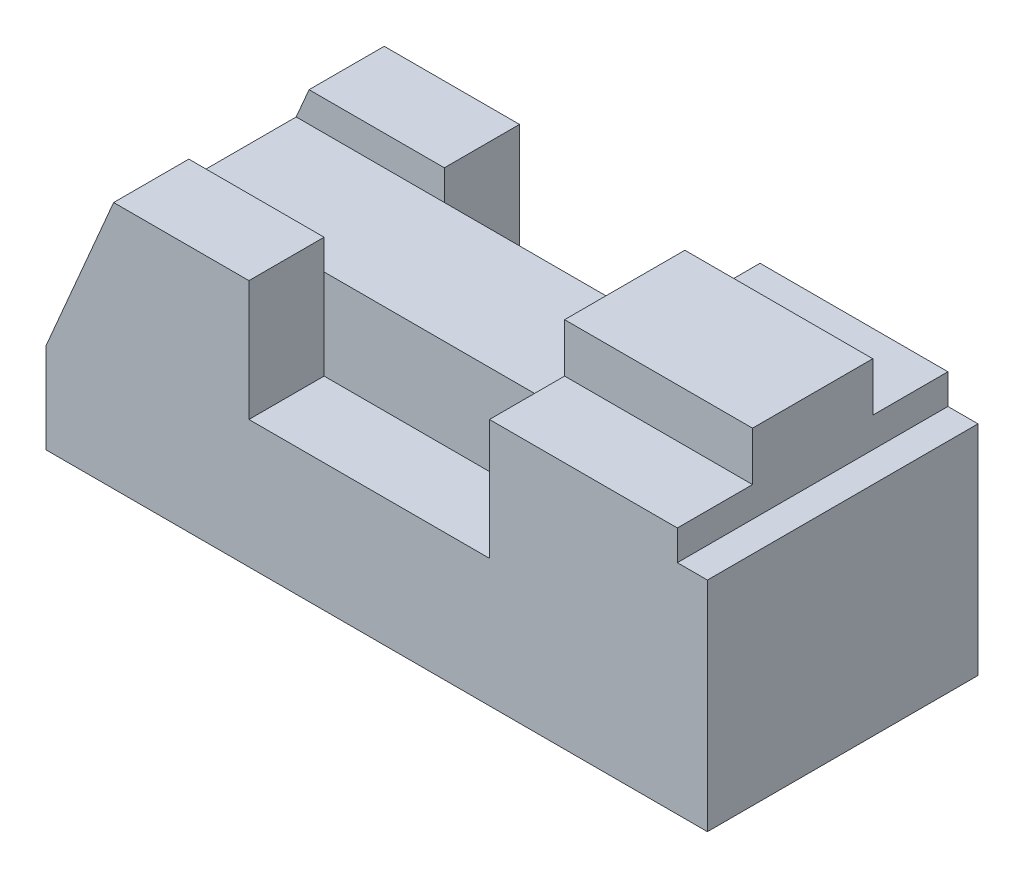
ISO-10303-21;
HEADER;
FILE_DESCRIPTION(('STEP AP214'),'2;1');
FILE_NAME('part.step','',(''),(''),'','','');
FILE_SCHEMA(('AUTOMOTIVE_DESIGN { 1 0 10303 214 1 1 1 1 }'));
ENDSEC;
DATA;
#1=APPLICATION_CONTEXT('core data for automotive mechanical design processes');
#2=APPLICATION_PROTOCOL_DEFINITION('international standard','automotive_design',2000,#1);
#3=PRODUCT_CONTEXT('',#1,'mechanical');
#4=PRODUCT('Part','Part','',(#3));
#5=PRODUCT_RELATED_PRODUCT_CATEGORY('part','',(#4));
#6=PRODUCT_DEFINITION_FORMATION('','',#4);
#7=PRODUCT_DEFINITION_CONTEXT('part definition',#1,'design');
#8=PRODUCT_DEFINITION('design','',#6,#7);
#9=PRODUCT_DEFINITION_SHAPE('','',#8);
#10=(LENGTH_UNIT() NAMED_UNIT(*) SI_UNIT(.MILLI.,.METRE.));
#11=(NAMED_UNIT(*) PLANE_ANGLE_UNIT() SI_UNIT($,.RADIAN.));
#12=(NAMED_UNIT(*) SI_UNIT($,.STERADIAN.) SOLID_ANGLE_UNIT());
#13=UNCERTAINTY_MEASURE_WITH_UNIT(LENGTH_MEASURE(1.E-05),#10,'distance_accuracy_value','');
#14=(GEOMETRIC_REPRESENTATION_CONTEXT(3) GLOBAL_UNCERTAINTY_ASSIGNED_CONTEXT((#13)) GLOBAL_UNIT_ASSIGNED_CONTEXT((#10,
#11,#12)) REPRESENTATION_CONTEXT('',''));
#15=CARTESIAN_POINT('',(0.,0.,0.));
#16=DIRECTION('',(0.,0.,1.));
#17=DIRECTION('',(1.,0.,0.));
#18=AXIS2_PLACEMENT_3D('',#15,#16,#17);
#19=CARTESIAN_POINT('',(352.,0.,-72.));
#20=DIRECTION('',(0.,0.,1.));
#21=DIRECTION('',(1.,0.,0.));
#22=AXIS2_PLACEMENT_3D('',#19,#20,#21);
#23=PLANE('',#22);
#24=DIRECTION('',(0.,1.,0.));
#25=VECTOR('',#24,1.);
#26=CARTESIAN_POINT('',(108.,132.,-72.));
#27=LINE('',#26,#25);
#28=CARTESIAN_POINT('',(108.,68.,-72.));
#29=VERTEX_POINT('',#28);
#30=CARTESIAN_POINT('',(108.,132.,-72.));
#31=VERTEX_POINT('',#30);
#32=EDGE_CURVE('E257',#29,#31,#27,.T.);
#33=ORIENTED_EDGE('',*,*,#32,.F.);
#34=DIRECTION('',(1.,0.,0.));
#35=VECTOR('',#34,1.);
#36=CARTESIAN_POINT('',(236.,68.,-72.));
#37=LINE('',#36,#35);
#38=CARTESIAN_POINT('',(236.,68.,-72.));
#39=VERTEX_POINT('',#38);
#40=EDGE_CURVE('E202',#29,#39,#37,.T.);
#41=ORIENTED_EDGE('',*,*,#40,.T.);
#42=DIRECTION('',(0.,-1.,0.));
#43=VECTOR('',#42,1.);
#44=CARTESIAN_POINT('',(236.,116.,-72.));
#45=LINE('',#44,#43);
#46=CARTESIAN_POINT('',(236.,132.,-72.));
#47=VERTEX_POINT('',#46);
#48=EDGE_CURVE('E264',#47,#39,#45,.T.);
#49=ORIENTED_EDGE('',*,*,#48,.F.);
#50=DIRECTION('',(-1.,0.,0.));
#51=VECTOR('',#50,1.);
#52=CARTESIAN_POINT('',(236.,132.,-72.));
#53=LINE('',#52,#51);
#54=CARTESIAN_POINT('',(336.,132.,-72.));
#55=VERTEX_POINT('',#54);
#56=EDGE_CURVE('E268',#55,#47,#53,.T.);
#57=ORIENTED_EDGE('',*,*,#56,.F.);
#58=DIRECTION('',(0.,1.,0.));
#59=VECTOR('',#58,1.);
#60=CARTESIAN_POINT('',(336.,132.,-72.));
#61=LINE('',#60,#59);
#62=CARTESIAN_POINT('',(336.,116.,-72.));
#63=VERTEX_POINT('',#62);
#64=EDGE_CURVE('E271',#63,#55,#61,.T.);
#65=ORIENTED_EDGE('',*,*,#64,.F.);
#66=DIRECTION('',(-1.,0.,0.));
#67=VECTOR('',#66,1.);
#68=CARTESIAN_POINT('',(336.,116.,-72.));
#69=LINE('',#68,#67);
#70=CARTESIAN_POINT('',(352.,116.,-72.));
#71=VERTEX_POINT('',#70);
#72=EDGE_CURVE('E274',#71,#63,#69,.T.);
#73=ORIENTED_EDGE('',*,*,#72,.F.);
#74=DIRECTION('',(0.,1.,0.));
#75=VECTOR('',#74,1.);
#76=CARTESIAN_POINT('',(352.,116.,-72.));
#77=LINE('',#76,#75);
#78=CARTESIAN_POINT('',(352.,0.,-72.));
#79=VERTEX_POINT('',#78);
#80=EDGE_CURVE('E277',#79,#71,#77,.T.);
#81=ORIENTED_EDGE('',*,*,#80,.F.);
#82=DIRECTION('',(1.,0.,0.));
#83=VECTOR('',#82,1.);
#84=CARTESIAN_POINT('',(352.,0.,-72.));
#85=LINE('',#84,#83);
#86=CARTESIAN_POINT('',(0.,0.,-72.));
#87=VERTEX_POINT('',#86);
#88=EDGE_CURVE('E279',#87,#79,#85,.T.);
#89=ORIENTED_EDGE('',*,*,#88,.F.);
#90=DIRECTION('',(0.,-1.,0.));
#91=VECTOR('',#90,1.);
#92=CARTESIAN_POINT('',(0.,0.,-72.));
#93=LINE('',#92,#91);
#94=CARTESIAN_POINT('',(0.,48.,-72.));
#95=VERTEX_POINT('',#94);
#96=EDGE_CURVE('E228',#95,#87,#93,.T.);
#97=ORIENTED_EDGE('',*,*,#96,.F.);
#98=DIRECTION('',(-0.393919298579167,-0.919145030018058,0.));
#99=VECTOR('',#98,1.);
#100=CARTESIAN_POINT('',(0.,48.,-72.));
#101=LINE('',#100,#99);
#102=CARTESIAN_POINT('',(36.,132.,-72.));
#103=VERTEX_POINT('',#102);
#104=EDGE_CURVE('E230',#103,#95,#101,.T.);
#105=ORIENTED_EDGE('',*,*,#104,.F.);
#106=DIRECTION('',(-1.,0.,0.));
#107=VECTOR('',#106,1.);
#108=CARTESIAN_POINT('',(36.,132.,-72.));
#109=LINE('',#108,#107);
#110=EDGE_CURVE('E235',#31,#103,#109,.T.);
#111=ORIENTED_EDGE('',*,*,#110,.F.);
#112=EDGE_LOOP('',(#33,#41,#49,#57,#65,#73,#81,#89,#97,#105,#111));
#113=FACE_BOUND('',#112,.T.);
#114=ADVANCED_FACE('F31',(#113),#23,.F.);
#115=CARTESIAN_POINT('',(236.,132.,-72.));
#116=DIRECTION('',(0.,1.,0.));
#117=DIRECTION('',(-1.,0.,0.));
#118=AXIS2_PLACEMENT_3D('',#115,#116,#117);
#119=PLANE('',#118);
#120=DIRECTION('',(0.,0.,1.));
#121=VECTOR('',#120,1.);
#122=CARTESIAN_POINT('',(336.,132.,-72.));
#123=LINE('',#122,#121);
#124=CARTESIAN_POINT('',(336.,132.,32.));
#125=VERTEX_POINT('',#124);
#126=CARTESIAN_POINT('',(336.,132.,72.));
#127=VERTEX_POINT('',#126);
#128=EDGE_CURVE('E221',#125,#127,#123,.T.);
#129=ORIENTED_EDGE('',*,*,#128,.F.);
#130=DIRECTION('',(1.,0.,0.));
#131=VECTOR('',#130,1.);
#132=CARTESIAN_POINT('',(336.,132.,32.));
#133=LINE('',#132,#131);
#134=CARTESIAN_POINT('',(236.,132.,32.));
#135=VERTEX_POINT('',#134);
#136=EDGE_CURVE('E48',#135,#125,#133,.T.);
#137=ORIENTED_EDGE('',*,*,#136,.F.);
#138=DIRECTION('',(0.,0.,1.));
#139=VECTOR('',#138,1.);
#140=CARTESIAN_POINT('',(236.,132.,-72.));
#141=LINE('',#140,#139);
#142=CARTESIAN_POINT('',(236.,132.,72.));
#143=VERTEX_POINT('',#142);
#144=EDGE_CURVE('E214',#135,#143,#141,.T.);
#145=ORIENTED_EDGE('',*,*,#144,.T.);
#146=DIRECTION('',(-1.,0.,0.));
#147=VECTOR('',#146,1.);
#148=CARTESIAN_POINT('',(236.,132.,72.));
#149=LINE('',#148,#147);
#150=EDGE_CURVE('E294',#127,#143,#149,.T.);
#151=ORIENTED_EDGE('',*,*,#150,.F.);
#152=EDGE_LOOP('',(#129,#137,#145,#151));
#153=FACE_BOUND('',#152,.T.);
#154=ADVANCED_FACE('F395',(#153),#119,.T.);
#155=CARTESIAN_POINT('',(236.,132.,-32.));
#156=VERTEX_POINT('',#155);
#157=EDGE_CURVE('E209',#47,#156,#141,.T.);
#158=ORIENTED_EDGE('',*,*,#157,.T.);
#159=DIRECTION('',(-1.,0.,0.));
#160=VECTOR('',#159,1.);
#161=CARTESIAN_POINT('',(236.,132.,-32.));
#162=LINE('',#161,#160);
#163=CARTESIAN_POINT('',(336.,132.,-32.));
#164=VERTEX_POINT('',#163);
#165=EDGE_CURVE('E354',#164,#156,#162,.T.);
#166=ORIENTED_EDGE('',*,*,#165,.F.);
#167=EDGE_CURVE('E218',#55,#164,#123,.T.);
#168=ORIENTED_EDGE('',*,*,#167,.F.);
#169=ORIENTED_EDGE('',*,*,#56,.T.);
#170=EDGE_LOOP('',(#158,#166,#168,#169));
#171=FACE_BOUND('',#170,.T.);
#172=ADVANCED_FACE('F378',(#171),#119,.T.);
#173=CARTESIAN_POINT('',(36.,132.,-72.));
#174=DIRECTION('',(0.,1.,0.));
#175=DIRECTION('',(0.,0.,1.));
#176=AXIS2_PLACEMENT_3D('',#173,#174,#175);
#177=PLANE('',#176);
#178=DIRECTION('',(-1.,0.,0.));
#179=VECTOR('',#178,1.);
#180=CARTESIAN_POINT('',(179.226102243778,132.,-32.));
#181=LINE('',#180,#179);
#182=CARTESIAN_POINT('',(108.,132.,-32.));
#183=VERTEX_POINT('',#182);
#184=CARTESIAN_POINT('',(36.,132.,-32.));
#185=VERTEX_POINT('',#184);
#186=EDGE_CURVE('E260',#183,#185,#181,.T.);
#187=ORIENTED_EDGE('',*,*,#186,.F.);
#188=DIRECTION('',(0.,0.,1.));
#189=VECTOR('',#188,1.);
#190=CARTESIAN_POINT('',(108.,132.,-72.));
#191=LINE('',#190,#189);
#192=EDGE_CURVE('E211',#31,#183,#191,.T.);
#193=ORIENTED_EDGE('',*,*,#192,.F.);
#194=ORIENTED_EDGE('',*,*,#110,.T.);
#195=DIRECTION('',(0.,0.,1.));
#196=VECTOR('',#195,1.);
#197=CARTESIAN_POINT('',(36.,132.,-72.));
#198=LINE('',#197,#196);
#199=EDGE_CURVE('E239',#103,#185,#198,.T.);
#200=ORIENTED_EDGE('',*,*,#199,.T.);
#201=EDGE_LOOP('',(#187,#193,#194,#200));
#202=FACE_BOUND('',#201,.T.);
#203=ADVANCED_FACE('F259',(#202),#177,.T.);
#204=CARTESIAN_POINT('',(108.,132.,-72.));
#205=DIRECTION('',(1.,0.,0.));
#206=DIRECTION('',(0.,0.,-1.));
#207=AXIS2_PLACEMENT_3D('',#204,#205,#206);
#208=PLANE('',#207);
#209=DIRECTION('',(0.,1.,0.));
#210=VECTOR('',#209,1.);
#211=CARTESIAN_POINT('',(108.,132.,-32.));
#212=LINE('',#211,#210);
#213=CARTESIAN_POINT('',(108.,116.,-32.));
#214=VERTEX_POINT('',#213);
#215=EDGE_CURVE('E255',#214,#183,#212,.T.);
#216=ORIENTED_EDGE('',*,*,#215,.F.);
#217=DIRECTION('',(0.,-1.,0.));
#218=VECTOR('',#217,1.);
#219=CARTESIAN_POINT('',(108.,116.,-32.));
#220=LINE('',#219,#218);
#221=CARTESIAN_POINT('',(108.,68.,-32.));
#222=VERTEX_POINT('',#221);
#223=EDGE_CURVE('E198',#214,#222,#220,.T.);
#224=ORIENTED_EDGE('',*,*,#223,.T.);
#225=DIRECTION('',(0.,0.,-1.));
#226=VECTOR('',#225,1.);
#227=CARTESIAN_POINT('',(108.,68.,-32.));
#228=LINE('',#227,#226);
#229=EDGE_CURVE('E358',#222,#29,#228,.T.);
#230=ORIENTED_EDGE('',*,*,#229,.T.);
#231=ORIENTED_EDGE('',*,*,#32,.T.);
#232=ORIENTED_EDGE('',*,*,#192,.T.);
#233=EDGE_LOOP('',(#216,#224,#230,#231,#232));
#234=FACE_BOUND('',#233,.T.);
#235=ADVANCED_FACE('F254',(#234),#208,.T.);
#236=CARTESIAN_POINT('',(352.,0.,-72.));
#237=DIRECTION('',(0.,-1.,0.));
#238=DIRECTION('',(1.,0.,0.));
#239=AXIS2_PLACEMENT_3D('',#236,#237,#238);
#240=PLANE('',#239);
#241=DIRECTION('',(0.,0.,1.));
#242=VECTOR('',#241,1.);
#243=CARTESIAN_POINT('',(352.,0.,-72.));
#244=LINE('',#243,#242);
#245=CARTESIAN_POINT('',(352.,0.,72.));
#246=VERTEX_POINT('',#245);
#247=EDGE_CURVE('E35',#79,#246,#244,.T.);
#248=ORIENTED_EDGE('',*,*,#247,.T.);
#249=DIRECTION('',(1.,0.,0.));
#250=VECTOR('',#249,1.);
#251=CARTESIAN_POINT('',(352.,0.,72.));
#252=LINE('',#251,#250);
#253=CARTESIAN_POINT('',(0.,0.,72.));
#254=VERTEX_POINT('',#253);
#255=EDGE_CURVE('E305',#254,#246,#252,.T.);
#256=ORIENTED_EDGE('',*,*,#255,.F.);
#257=DIRECTION('',(0.,0.,1.));
#258=VECTOR('',#257,1.);
#259=CARTESIAN_POINT('',(0.,0.,-72.));
#260=LINE('',#259,#258);
#261=EDGE_CURVE('E11',#87,#254,#260,.T.);
#262=ORIENTED_EDGE('',*,*,#261,.F.);
#263=ORIENTED_EDGE('',*,*,#88,.T.);
#264=EDGE_LOOP('',(#248,#256,#262,#263));
#265=FACE_BOUND('',#264,.T.);
#266=ADVANCED_FACE('F33',(#265),#240,.T.);
#267=CARTESIAN_POINT('',(0.,0.,-72.));
#268=DIRECTION('',(-1.,0.,0.));
#269=DIRECTION('',(0.,0.,1.));
#270=AXIS2_PLACEMENT_3D('',#267,#268,#269);
#271=PLANE('',#270);
#272=ORIENTED_EDGE('',*,*,#261,.T.);
#273=DIRECTION('',(0.,-1.,0.));
#274=VECTOR('',#273,1.);
#275=CARTESIAN_POINT('',(0.,0.,72.));
#276=LINE('',#275,#274);
#277=CARTESIAN_POINT('',(0.,48.,72.));
#278=VERTEX_POINT('',#277);
#279=EDGE_CURVE('E281',#278,#254,#276,.T.);
#280=ORIENTED_EDGE('',*,*,#279,.F.);
#281=DIRECTION('',(0.,0.,1.));
#282=VECTOR('',#281,1.);
#283=CARTESIAN_POINT('',(0.,48.,-72.));
#284=LINE('',#283,#282);
#285=EDGE_CURVE('E40',#95,#278,#284,.T.);
#286=ORIENTED_EDGE('',*,*,#285,.F.);
#287=ORIENTED_EDGE('',*,*,#96,.T.);
#288=EDGE_LOOP('',(#272,#280,#286,#287));
#289=FACE_BOUND('',#288,.T.);
#290=ADVANCED_FACE('F418',(#289),#271,.T.);
#291=CARTESIAN_POINT('',(0.,48.,-72.));
#292=DIRECTION('',(-0.919145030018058,0.393919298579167,0.));
#293=DIRECTION('',(-0.393919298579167,-0.919145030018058,0.));
#294=AXIS2_PLACEMENT_3D('',#291,#292,#293);
#295=PLANE('',#294);
#296=DIRECTION('',(-0.393919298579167,-0.919145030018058,0.));
#297=VECTOR('',#296,1.);
#298=CARTESIAN_POINT('',(0.,48.,-32.));
#299=LINE('',#298,#297);
#300=CARTESIAN_POINT('',(29.1428571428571,116.,-32.));
#301=VERTEX_POINT('',#300);
#302=EDGE_CURVE('E318',#185,#301,#299,.T.);
#303=ORIENTED_EDGE('',*,*,#302,.F.);
#304=ORIENTED_EDGE('',*,*,#199,.F.);
#305=ORIENTED_EDGE('',*,*,#104,.T.);
#306=ORIENTED_EDGE('',*,*,#285,.T.);
#307=DIRECTION('',(-0.393919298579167,-0.919145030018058,0.));
#308=VECTOR('',#307,1.);
#309=CARTESIAN_POINT('',(0.,48.,72.));
#310=LINE('',#309,#308);
#311=CARTESIAN_POINT('',(36.,132.,72.));
#312=VERTEX_POINT('',#311);
#313=EDGE_CURVE('E284',#312,#278,#310,.T.);
#314=ORIENTED_EDGE('',*,*,#313,.F.);
#315=CARTESIAN_POINT('',(36.,132.,32.));
#316=VERTEX_POINT('',#315);
#317=EDGE_CURVE('E241',#316,#312,#198,.T.);
#318=ORIENTED_EDGE('',*,*,#317,.F.);
#319=DIRECTION('',(0.393919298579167,0.919145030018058,0.));
#320=VECTOR('',#319,1.);
#321=CARTESIAN_POINT('',(0.,48.,32.));
#322=LINE('',#321,#320);
#323=CARTESIAN_POINT('',(29.1428571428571,116.,32.));
#324=VERTEX_POINT('',#323);
#325=EDGE_CURVE('E329',#324,#316,#322,.T.);
#326=ORIENTED_EDGE('',*,*,#325,.F.);
#327=DIRECTION('',(0.,0.,1.));
#328=VECTOR('',#327,1.);
#329=CARTESIAN_POINT('',(29.1428571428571,116.,-72.));
#330=LINE('',#329,#328);
#331=EDGE_CURVE('E334',#301,#324,#330,.T.);
#332=ORIENTED_EDGE('',*,*,#331,.F.);
#333=EDGE_LOOP('',(#303,#304,#305,#306,#314,#318,#326,#332));
#334=FACE_BOUND('',#333,.T.);
#335=ADVANCED_FACE('F416',(#334),#295,.T.);
#336=DIRECTION('',(-1.,0.,0.));
#337=VECTOR('',#336,1.);
#338=CARTESIAN_POINT('',(179.226102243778,132.,32.));
#339=LINE('',#338,#337);
#340=CARTESIAN_POINT('',(108.,132.,32.));
#341=VERTEX_POINT('',#340);
#342=EDGE_CURVE('E342',#341,#316,#339,.T.);
#343=ORIENTED_EDGE('',*,*,#342,.T.);
#344=ORIENTED_EDGE('',*,*,#317,.T.);
#345=DIRECTION('',(-1.,0.,0.));
#346=VECTOR('',#345,1.);
#347=CARTESIAN_POINT('',(36.,132.,72.));
#348=LINE('',#347,#346);
#349=CARTESIAN_POINT('',(108.,132.,72.));
#350=VERTEX_POINT('',#349);
#351=EDGE_CURVE('E287',#350,#312,#348,.T.);
#352=ORIENTED_EDGE('',*,*,#351,.F.);
#353=EDGE_CURVE('E208',#341,#350,#191,.T.);
#354=ORIENTED_EDGE('',*,*,#353,.F.);
#355=EDGE_LOOP('',(#343,#344,#352,#354));
#356=FACE_BOUND('',#355,.T.);
#357=ADVANCED_FACE('F406',(#356),#177,.T.);
#358=DIRECTION('',(0.,-1.,0.));
#359=VECTOR('',#358,1.);
#360=CARTESIAN_POINT('',(108.,132.,32.));
#361=LINE('',#360,#359);
#362=CARTESIAN_POINT('',(108.,116.,32.));
#363=VERTEX_POINT('',#362);
#364=EDGE_CURVE('E331',#341,#363,#361,.T.);
#365=ORIENTED_EDGE('',*,*,#364,.F.);
#366=ORIENTED_EDGE('',*,*,#353,.T.);
#367=DIRECTION('',(0.,1.,0.));
#368=VECTOR('',#367,1.);
#369=CARTESIAN_POINT('',(108.,132.,72.));
#370=LINE('',#369,#368);
#371=CARTESIAN_POINT('',(108.,68.,72.));
#372=VERTEX_POINT('',#371);
#373=EDGE_CURVE('E289',#372,#350,#370,.T.);
#374=ORIENTED_EDGE('',*,*,#373,.F.);
#375=DIRECTION('',(0.,0.,1.));
#376=VECTOR('',#375,1.);
#377=CARTESIAN_POINT('',(108.,68.,32.));
#378=LINE('',#377,#376);
#379=CARTESIAN_POINT('',(108.,68.,32.));
#380=VERTEX_POINT('',#379);
#381=EDGE_CURVE('E309',#380,#372,#378,.T.);
#382=ORIENTED_EDGE('',*,*,#381,.F.);
#383=DIRECTION('',(0.,-1.,0.));
#384=VECTOR('',#383,1.);
#385=CARTESIAN_POINT('',(108.,116.,32.));
#386=LINE('',#385,#384);
#387=EDGE_CURVE('E323',#363,#380,#386,.T.);
#388=ORIENTED_EDGE('',*,*,#387,.F.);
#389=EDGE_LOOP('',(#365,#366,#374,#382,#388));
#390=FACE_BOUND('',#389,.T.);
#391=ADVANCED_FACE('F408',(#390),#208,.T.);
#392=CARTESIAN_POINT('',(108.,116.,-72.));
#393=DIRECTION('',(0.,1.,0.));
#394=DIRECTION('',(0.,0.,1.));
#395=AXIS2_PLACEMENT_3D('',#392,#393,#394);
#396=PLANE('',#395);
#397=DIRECTION('',(-1.,0.,0.));
#398=VECTOR('',#397,1.);
#399=CARTESIAN_POINT('',(108.,116.,-32.));
#400=LINE('',#399,#398);
#401=CARTESIAN_POINT('',(236.,116.,-32.));
#402=VERTEX_POINT('',#401);
#403=EDGE_CURVE('E194',#402,#214,#400,.T.);
#404=ORIENTED_EDGE('',*,*,#403,.T.);
#405=DIRECTION('',(-1.,0.,0.));
#406=VECTOR('',#405,1.);
#407=CARTESIAN_POINT('',(179.226102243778,116.,-32.));
#408=LINE('',#407,#406);
#409=EDGE_CURVE('E336',#214,#301,#408,.T.);
#410=ORIENTED_EDGE('',*,*,#409,.T.);
#411=ORIENTED_EDGE('',*,*,#331,.T.);
#412=DIRECTION('',(-1.,0.,0.));
#413=VECTOR('',#412,1.);
#414=CARTESIAN_POINT('',(179.226102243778,116.,32.));
#415=LINE('',#414,#413);
#416=EDGE_CURVE('E338',#363,#324,#415,.T.);
#417=ORIENTED_EDGE('',*,*,#416,.F.);
#418=DIRECTION('',(-1.,0.,0.));
#419=VECTOR('',#418,1.);
#420=CARTESIAN_POINT('',(108.,116.,32.));
#421=LINE('',#420,#419);
#422=CARTESIAN_POINT('',(236.,116.,32.));
#423=VERTEX_POINT('',#422);
#424=EDGE_CURVE('E207',#423,#363,#421,.T.);
#425=ORIENTED_EDGE('',*,*,#424,.F.);
#426=DIRECTION('',(0.,0.,1.));
#427=VECTOR('',#426,1.);
#428=CARTESIAN_POINT('',(236.,116.,-72.));
#429=LINE('',#428,#427);
#430=EDGE_CURVE('E187',#402,#423,#429,.T.);
#431=ORIENTED_EDGE('',*,*,#430,.F.);
#432=EDGE_LOOP('',(#404,#410,#411,#417,#425,#431));
#433=FACE_BOUND('',#432,.T.);
#434=ADVANCED_FACE('F205',(#433),#396,.T.);
#435=CARTESIAN_POINT('',(236.,116.,-72.));
#436=DIRECTION('',(-1.,0.,0.));
#437=DIRECTION('',(0.,0.,1.));
#438=AXIS2_PLACEMENT_3D('',#435,#436,#437);
#439=PLANE('',#438);
#440=ORIENTED_EDGE('',*,*,#48,.T.);
#441=DIRECTION('',(0.,0.,-1.));
#442=VECTOR('',#441,1.);
#443=CARTESIAN_POINT('',(236.,68.,-32.));
#444=LINE('',#443,#442);
#445=CARTESIAN_POINT('',(236.,68.,-32.));
#446=VERTEX_POINT('',#445);
#447=EDGE_CURVE('E190',#446,#39,#444,.T.);
#448=ORIENTED_EDGE('',*,*,#447,.F.);
#449=DIRECTION('',(0.,1.,0.));
#450=VECTOR('',#449,1.);
#451=CARTESIAN_POINT('',(236.,116.,-32.));
#452=LINE('',#451,#450);
#453=EDGE_CURVE('E182',#446,#402,#452,.T.);
#454=ORIENTED_EDGE('',*,*,#453,.T.);
#455=ORIENTED_EDGE('',*,*,#430,.T.);
#456=DIRECTION('',(0.,1.,0.));
#457=VECTOR('',#456,1.);
#458=CARTESIAN_POINT('',(236.,116.,32.));
#459=LINE('',#458,#457);
#460=CARTESIAN_POINT('',(236.,68.,32.));
#461=VERTEX_POINT('',#460);
#462=EDGE_CURVE('E312',#461,#423,#459,.T.);
#463=ORIENTED_EDGE('',*,*,#462,.F.);
#464=DIRECTION('',(0.,0.,1.));
#465=VECTOR('',#464,1.);
#466=CARTESIAN_POINT('',(236.,68.,32.));
#467=LINE('',#466,#465);
#468=CARTESIAN_POINT('',(236.,68.,72.));
#469=VERTEX_POINT('',#468);
#470=EDGE_CURVE('E308',#461,#469,#467,.T.);
#471=ORIENTED_EDGE('',*,*,#470,.T.);
#472=DIRECTION('',(0.,-1.,0.));
#473=VECTOR('',#472,1.);
#474=CARTESIAN_POINT('',(236.,116.,72.));
#475=LINE('',#474,#473);
#476=EDGE_CURVE('E292',#143,#469,#475,.T.);
#477=ORIENTED_EDGE('',*,*,#476,.F.);
#478=ORIENTED_EDGE('',*,*,#144,.F.);
#479=DIRECTION('',(0.,-1.,0.));
#480=VECTOR('',#479,1.);
#481=CARTESIAN_POINT('',(236.,158.,32.));
#482=LINE('',#481,#480);
#483=CARTESIAN_POINT('',(236.,158.,32.));
#484=VERTEX_POINT('',#483);
#485=EDGE_CURVE('E351',#484,#135,#482,.T.);
#486=ORIENTED_EDGE('',*,*,#485,.F.);
#487=DIRECTION('',(0.,0.,1.));
#488=VECTOR('',#487,1.);
#489=CARTESIAN_POINT('',(236.,158.,32.));
#490=LINE('',#489,#488);
#491=CARTESIAN_POINT('',(236.,158.,-32.));
#492=VERTEX_POINT('',#491);
#493=EDGE_CURVE('E353',#492,#484,#490,.T.);
#494=ORIENTED_EDGE('',*,*,#493,.F.);
#495=DIRECTION('',(0.,-1.,0.));
#496=VECTOR('',#495,1.);
#497=CARTESIAN_POINT('',(236.,158.,-32.));
#498=LINE('',#497,#496);
#499=EDGE_CURVE('E348',#492,#156,#498,.T.);
#500=ORIENTED_EDGE('',*,*,#499,.T.);
#501=ORIENTED_EDGE('',*,*,#157,.F.);
#502=EDGE_LOOP('',(#440,#448,#454,#455,#463,#471,#477,#478,#486,#494,#500,#501));
#503=FACE_BOUND('',#502,.T.);
#504=ADVANCED_FACE('F184',(#503),#439,.T.);
#505=CARTESIAN_POINT('',(336.,132.,-72.));
#506=DIRECTION('',(1.,0.,0.));
#507=DIRECTION('',(0.,0.,-1.));
#508=AXIS2_PLACEMENT_3D('',#505,#506,#507);
#509=PLANE('',#508);
#510=ORIENTED_EDGE('',*,*,#167,.T.);
#511=DIRECTION('',(0.,-1.,0.));
#512=VECTOR('',#511,1.);
#513=CARTESIAN_POINT('',(336.,158.,-32.));
#514=LINE('',#513,#512);
#515=CARTESIAN_POINT('',(336.,158.,-32.));
#516=VERTEX_POINT('',#515);
#517=EDGE_CURVE('E346',#516,#164,#514,.T.);
#518=ORIENTED_EDGE('',*,*,#517,.F.);
#519=DIRECTION('',(0.,0.,-1.));
#520=VECTOR('',#519,1.);
#521=CARTESIAN_POINT('',(336.,158.,-32.));
#522=LINE('',#521,#520);
#523=CARTESIAN_POINT('',(336.,158.,32.));
#524=VERTEX_POINT('',#523);
#525=EDGE_CURVE('E362',#524,#516,#522,.T.);
#526=ORIENTED_EDGE('',*,*,#525,.F.);
#527=DIRECTION('',(0.,-1.,0.));
#528=VECTOR('',#527,1.);
#529=CARTESIAN_POINT('',(336.,158.,32.));
#530=LINE('',#529,#528);
#531=EDGE_CURVE('E339',#524,#125,#530,.T.);
#532=ORIENTED_EDGE('',*,*,#531,.T.);
#533=ORIENTED_EDGE('',*,*,#128,.T.);
#534=DIRECTION('',(0.,1.,0.));
#535=VECTOR('',#534,1.);
#536=CARTESIAN_POINT('',(336.,132.,72.));
#537=LINE('',#536,#535);
#538=CARTESIAN_POINT('',(336.,116.,72.));
#539=VERTEX_POINT('',#538);
#540=EDGE_CURVE('E297',#539,#127,#537,.T.);
#541=ORIENTED_EDGE('',*,*,#540,.F.);
#542=DIRECTION('',(0.,0.,1.));
#543=VECTOR('',#542,1.);
#544=CARTESIAN_POINT('',(336.,116.,-72.));
#545=LINE('',#544,#543);
#546=EDGE_CURVE('E222',#63,#539,#545,.T.);
#547=ORIENTED_EDGE('',*,*,#546,.F.);
#548=ORIENTED_EDGE('',*,*,#64,.T.);
#549=EDGE_LOOP('',(#510,#518,#526,#532,#533,#541,#547,#548));
#550=FACE_BOUND('',#549,.T.);
#551=ADVANCED_FACE('F382',(#550),#509,.T.);
#552=CARTESIAN_POINT('',(336.,116.,-72.));
#553=DIRECTION('',(0.,1.,0.));
#554=DIRECTION('',(0.,0.,1.));
#555=AXIS2_PLACEMENT_3D('',#552,#553,#554);
#556=PLANE('',#555);
#557=ORIENTED_EDGE('',*,*,#546,.T.);
#558=DIRECTION('',(-1.,0.,0.));
#559=VECTOR('',#558,1.);
#560=CARTESIAN_POINT('',(336.,116.,72.));
#561=LINE('',#560,#559);
#562=CARTESIAN_POINT('',(352.,116.,72.));
#563=VERTEX_POINT('',#562);
#564=EDGE_CURVE('E300',#563,#539,#561,.T.);
#565=ORIENTED_EDGE('',*,*,#564,.F.);
#566=DIRECTION('',(0.,0.,1.));
#567=VECTOR('',#566,1.);
#568=CARTESIAN_POINT('',(352.,116.,-72.));
#569=LINE('',#568,#567);
#570=EDGE_CURVE('E223',#71,#563,#569,.T.);
#571=ORIENTED_EDGE('',*,*,#570,.F.);
#572=ORIENTED_EDGE('',*,*,#72,.T.);
#573=EDGE_LOOP('',(#557,#565,#571,#572));
#574=FACE_BOUND('',#573,.T.);
#575=ADVANCED_FACE('F388',(#574),#556,.T.);
#576=CARTESIAN_POINT('',(352.,116.,-72.));
#577=DIRECTION('',(1.,0.,0.));
#578=DIRECTION('',(0.,0.,-1.));
#579=AXIS2_PLACEMENT_3D('',#576,#577,#578);
#580=PLANE('',#579);
#581=ORIENTED_EDGE('',*,*,#570,.T.);
#582=DIRECTION('',(0.,1.,0.));
#583=VECTOR('',#582,1.);
#584=CARTESIAN_POINT('',(352.,116.,72.));
#585=LINE('',#584,#583);
#586=EDGE_CURVE('E303',#246,#563,#585,.T.);
#587=ORIENTED_EDGE('',*,*,#586,.F.);
#588=ORIENTED_EDGE('',*,*,#247,.F.);
#589=ORIENTED_EDGE('',*,*,#80,.T.);
#590=EDGE_LOOP('',(#581,#587,#588,#589));
#591=FACE_BOUND('',#590,.T.);
#592=ADVANCED_FACE('F447',(#591),#580,.T.);
#593=CARTESIAN_POINT('',(352.,0.,72.));
#594=DIRECTION('',(0.,0.,1.));
#595=DIRECTION('',(1.,0.,0.));
#596=AXIS2_PLACEMENT_3D('',#593,#594,#595);
#597=PLANE('',#596);
#598=ORIENTED_EDGE('',*,*,#476,.T.);
#599=DIRECTION('',(1.,0.,0.));
#600=VECTOR('',#599,1.);
#601=CARTESIAN_POINT('',(236.,68.,72.));
#602=LINE('',#601,#600);
#603=EDGE_CURVE('E315',#372,#469,#602,.T.);
#604=ORIENTED_EDGE('',*,*,#603,.F.);
#605=ORIENTED_EDGE('',*,*,#373,.T.);
#606=ORIENTED_EDGE('',*,*,#351,.T.);
#607=ORIENTED_EDGE('',*,*,#313,.T.);
#608=ORIENTED_EDGE('',*,*,#279,.T.);
#609=ORIENTED_EDGE('',*,*,#255,.T.);
#610=ORIENTED_EDGE('',*,*,#586,.T.);
#611=ORIENTED_EDGE('',*,*,#564,.T.);
#612=ORIENTED_EDGE('',*,*,#540,.T.);
#613=ORIENTED_EDGE('',*,*,#150,.T.);
#614=EDGE_LOOP('',(#598,#604,#605,#606,#607,#608,#609,#610,#611,#612,#613));
#615=FACE_BOUND('',#614,.T.);
#616=ADVANCED_FACE('F391',(#615),#597,.T.);
#617=CARTESIAN_POINT('',(236.,68.,32.));
#618=DIRECTION('',(0.,-1.,0.));
#619=DIRECTION('',(1.,0.,0.));
#620=AXIS2_PLACEMENT_3D('',#617,#618,#619);
#621=PLANE('',#620);
#622=ORIENTED_EDGE('',*,*,#603,.T.);
#623=ORIENTED_EDGE('',*,*,#470,.F.);
#624=DIRECTION('',(1.,0.,0.));
#625=VECTOR('',#624,1.);
#626=CARTESIAN_POINT('',(236.,68.,32.));
#627=LINE('',#626,#625);
#628=EDGE_CURVE('E320',#380,#461,#627,.T.);
#629=ORIENTED_EDGE('',*,*,#628,.F.);
#630=ORIENTED_EDGE('',*,*,#381,.T.);
#631=EDGE_LOOP('',(#622,#623,#629,#630));
#632=FACE_BOUND('',#631,.T.);
#633=ADVANCED_FACE('F402',(#632),#621,.F.);
#634=CARTESIAN_POINT('',(236.,116.,32.));
#635=DIRECTION('',(0.,0.,-1.));
#636=DIRECTION('',(-1.,0.,0.));
#637=AXIS2_PLACEMENT_3D('',#634,#635,#636);
#638=PLANE('',#637);
#639=ORIENTED_EDGE('',*,*,#424,.T.);
#640=ORIENTED_EDGE('',*,*,#387,.T.);
#641=ORIENTED_EDGE('',*,*,#628,.T.);
#642=ORIENTED_EDGE('',*,*,#462,.T.);
#643=EDGE_LOOP('',(#639,#640,#641,#642));
#644=FACE_BOUND('',#643,.T.);
#645=ADVANCED_FACE('F455',(#644),#638,.F.);
#646=CARTESIAN_POINT('',(179.226102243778,116.,-32.));
#647=DIRECTION('',(0.,0.,-1.));
#648=DIRECTION('',(0.,1.,0.));
#649=AXIS2_PLACEMENT_3D('',#646,#647,#648);
#650=PLANE('',#649);
#651=ORIENTED_EDGE('',*,*,#302,.T.);
#652=ORIENTED_EDGE('',*,*,#409,.F.);
#653=ORIENTED_EDGE('',*,*,#215,.T.);
#654=ORIENTED_EDGE('',*,*,#186,.T.);
#655=EDGE_LOOP('',(#651,#652,#653,#654));
#656=FACE_BOUND('',#655,.T.);
#657=ADVANCED_FACE('F459',(#656),#650,.F.);
#658=CARTESIAN_POINT('',(179.226102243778,132.,32.));
#659=DIRECTION('',(0.,0.,1.));
#660=DIRECTION('',(1.,0.,0.));
#661=AXIS2_PLACEMENT_3D('',#658,#659,#660);
#662=PLANE('',#661);
#663=ORIENTED_EDGE('',*,*,#325,.T.);
#664=ORIENTED_EDGE('',*,*,#342,.F.);
#665=ORIENTED_EDGE('',*,*,#364,.T.);
#666=ORIENTED_EDGE('',*,*,#416,.T.);
#667=EDGE_LOOP('',(#663,#664,#665,#666));
#668=FACE_BOUND('',#667,.T.);
#669=ADVANCED_FACE('F411',(#668),#662,.F.);
#670=CARTESIAN_POINT('',(336.,158.,32.));
#671=DIRECTION('',(0.,0.,-1.));
#672=DIRECTION('',(-1.,0.,0.));
#673=AXIS2_PLACEMENT_3D('',#670,#671,#672);
#674=PLANE('',#673);
#675=ORIENTED_EDGE('',*,*,#136,.T.);
#676=ORIENTED_EDGE('',*,*,#531,.F.);
#677=DIRECTION('',(1.,0.,0.));
#678=VECTOR('',#677,1.);
#679=CARTESIAN_POINT('',(336.,158.,32.));
#680=LINE('',#679,#678);
#681=EDGE_CURVE('E356',#484,#524,#680,.T.);
#682=ORIENTED_EDGE('',*,*,#681,.F.);
#683=ORIENTED_EDGE('',*,*,#485,.T.);
#684=EDGE_LOOP('',(#675,#676,#682,#683));
#685=FACE_BOUND('',#684,.T.);
#686=ADVANCED_FACE('F468',(#685),#674,.F.);
#687=CARTESIAN_POINT('',(236.,158.,-32.));
#688=DIRECTION('',(0.,0.,1.));
#689=DIRECTION('',(1.,0.,0.));
#690=AXIS2_PLACEMENT_3D('',#687,#688,#689);
#691=PLANE('',#690);
#692=ORIENTED_EDGE('',*,*,#165,.T.);
#693=ORIENTED_EDGE('',*,*,#499,.F.);
#694=DIRECTION('',(-1.,0.,0.));
#695=VECTOR('',#694,1.);
#696=CARTESIAN_POINT('',(236.,158.,-32.));
#697=LINE('',#696,#695);
#698=EDGE_CURVE('E360',#516,#492,#697,.T.);
#699=ORIENTED_EDGE('',*,*,#698,.F.);
#700=ORIENTED_EDGE('',*,*,#517,.T.);
#701=EDGE_LOOP('',(#692,#693,#699,#700));
#702=FACE_BOUND('',#701,.T.);
#703=ADVANCED_FACE('F471',(#702),#691,.F.);
#704=CARTESIAN_POINT('',(236.,158.,32.));
#705=DIRECTION('',(0.,-1.,0.));
#706=DIRECTION('',(1.,0.,0.));
#707=AXIS2_PLACEMENT_3D('',#704,#705,#706);
#708=PLANE('',#707);
#709=ORIENTED_EDGE('',*,*,#681,.T.);
#710=ORIENTED_EDGE('',*,*,#525,.T.);
#711=ORIENTED_EDGE('',*,*,#698,.T.);
#712=ORIENTED_EDGE('',*,*,#493,.T.);
#713=EDGE_LOOP('',(#709,#710,#711,#712));
#714=FACE_BOUND('',#713,.T.);
#715=ADVANCED_FACE('F474',(#714),#708,.F.);
#716=CARTESIAN_POINT('',(236.,68.,-32.));
#717=DIRECTION('',(0.,1.,0.));
#718=DIRECTION('',(-1.,0.,0.));
#719=AXIS2_PLACEMENT_3D('',#716,#717,#718);
#720=PLANE('',#719);
#721=ORIENTED_EDGE('',*,*,#40,.F.);
#722=ORIENTED_EDGE('',*,*,#229,.F.);
#723=DIRECTION('',(1.,0.,0.));
#724=VECTOR('',#723,1.);
#725=CARTESIAN_POINT('',(236.,68.,-32.));
#726=LINE('',#725,#724);
#727=EDGE_CURVE('E193',#222,#446,#726,.T.);
#728=ORIENTED_EDGE('',*,*,#727,.T.);
#729=ORIENTED_EDGE('',*,*,#447,.T.);
#730=EDGE_LOOP('',(#721,#722,#728,#729));
#731=FACE_BOUND('',#730,.T.);
#732=ADVANCED_FACE('F373',(#731),#720,.T.);
#733=CARTESIAN_POINT('',(236.,116.,-32.));
#734=DIRECTION('',(0.,0.,1.));
#735=DIRECTION('',(-1.,0.,0.));
#736=AXIS2_PLACEMENT_3D('',#733,#734,#735);
#737=PLANE('',#736);
#738=ORIENTED_EDGE('',*,*,#403,.F.);
#739=ORIENTED_EDGE('',*,*,#453,.F.);
#740=ORIENTED_EDGE('',*,*,#727,.F.);
#741=ORIENTED_EDGE('',*,*,#223,.F.);
#742=EDGE_LOOP('',(#738,#739,#740,#741));
#743=FACE_BOUND('',#742,.T.);
#744=ADVANCED_FACE('F197',(#743),#737,.F.);
#745=CLOSED_SHELL('',(#114,#154,#172,#203,#235,#266,#290,#335,#357,#391,#434,#504,#551,#575,
#592,#616,#633,#645,#657,#669,#686,#703,#715,#732,#744));
#746=MANIFOLD_SOLID_BREP('B2',#745);
#747=ADVANCED_BREP_SHAPE_REPRESENTATION('',(#18,#746),#14);
#748=SHAPE_DEFINITION_REPRESENTATION(#9,#747);
ENDSEC;
END-ISO-10303-21;
